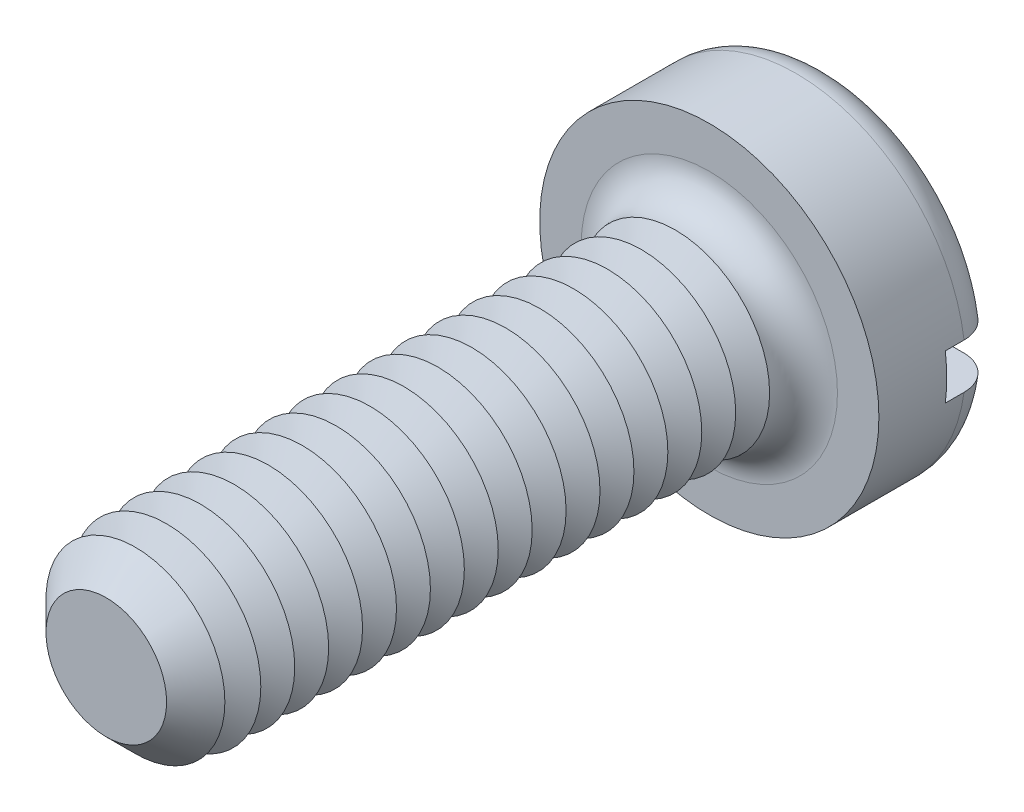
from build123d import *

# Parameters (mm, degrees)
SKETCH3_R           = 2.25
BOSS_EXTRUDE2_DEPTH = 1.6
SKETCH4_R           = 1.25
BOSS_EXTRUDE3_DEPTH = 8
FILLET1_R           = 0.45
CHAMFER1_SIZE       = 0.45
LPATTERN1_COUNT     = 16
LPATTERN1_PITCH     = 0.45
SKETCH8_W           = 4.5
SKETCH8_H           = 0.6
CUT_EXTRUDE1_DEPTH  = 0.7


with BuildPart() as part:
    # Sketch3 → Boss-Extrude2 (new body)
    with BuildSketch(Plane.XY):
        Circle(SKETCH3_R)
    extrude(amount=-BOSS_EXTRUDE2_DEPTH)

    # Sketch4 → Boss-Extrude3 (add)
    with BuildSketch(Plane.XY):
        Circle(SKETCH4_R)
    extrude(amount=BOSS_EXTRUDE3_DEPTH)

    # Fillet1
    fillet1_edges = [part.edges().sort_by_distance(p)[0] for p in [
        (-2.25, 0, -1.6),
        (-1.25, 0, 0),
    ]]
    fillet(fillet1_edges, radius=FILLET1_R)

    # Chamfer1
    chamfer1_edges = [part.edges().sort_by_distance(p)[0] for p in [
        (-1.25, 0, 8),
    ]]
    chamfer(chamfer1_edges, length=CHAMFER1_SIZE)

    # Sketch6 → Cut-Revolve1 (revolve, cut)
    with BuildSketch(Plane(origin=(0, 0, 0), x_dir=(0, 0, -1), z_dir=(1, 0, 0)), mode=Mode.PRIVATE) as cut_revolve1_sk:
        Polygon((-0.45, 1.25), (-0.675, 0.860288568), (-0.9, 1.25), align=None)
    cut_revolve1 = revolve(cut_revolve1_sk.sketch.rotate(Axis((0, 0, -1.694361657), (0, 0, 1)), 90), axis=Axis((0, 0, -1.694361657), (0, 0, 1)), mode=Mode.SUBTRACT)

    # LPattern1: Cut-Revolve1 ×16
    with Locations(*[(0, 0, i * LPATTERN1_PITCH) for i in range(1, LPATTERN1_COUNT)]):
        add(cut_revolve1, mode=Mode.SUBTRACT)

    # Sketch8 → Cut-Extrude1 (cut)
    with BuildSketch(Plane(origin=(0, 0, -1.6), x_dir=(-1, 0, 0), z_dir=(0, 0, -1))):
        Rectangle(SKETCH8_W, SKETCH8_H)
    extrude(amount=-CUT_EXTRUDE1_DEPTH, mode=Mode.SUBTRACT)


solid = part.part
